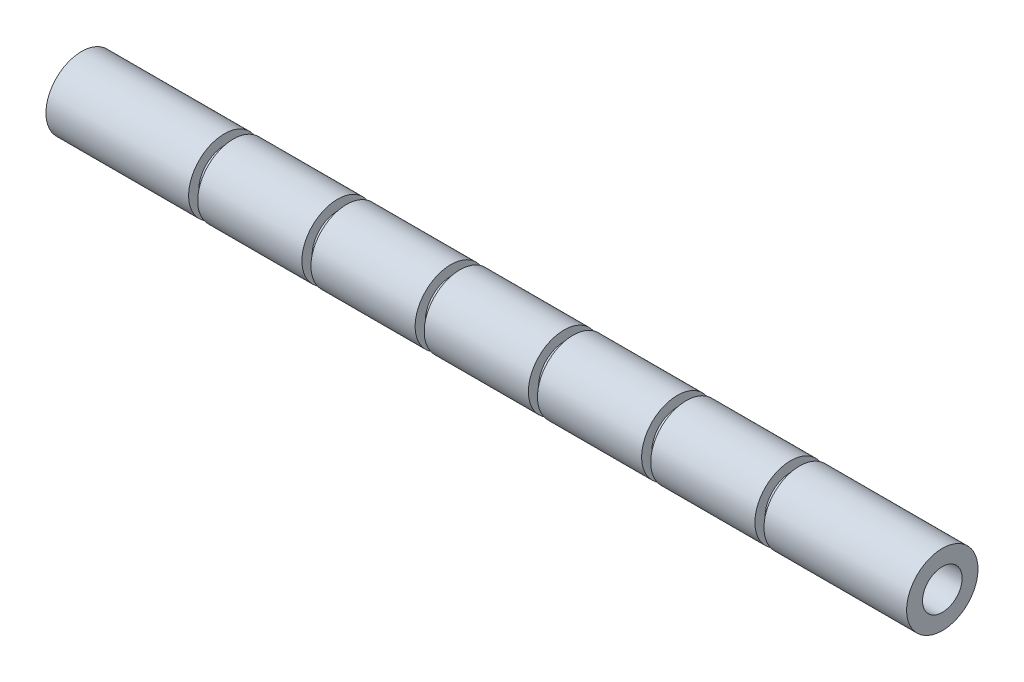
from build123d import *

# Parameters (mm, degrees)
ESQUISSE1_R                = 31.5
ESQUISSE1_R_2              = 17.5
EXTRUSION1_DEPTH           = 380
ESQUISSE2_W                = 8
ESQUISSE2_H                = 9
R_P_TITION_LIN_AIRE1_COUNT = 6
R_P_TITION_LIN_AIRE1_PITCH = 100


with BuildPart() as part:
    # Esquisse1 → Extrusion1 (new, symmetric)
    with BuildSketch(Plane(origin=(0, 0, 0), x_dir=(0, 0, -1), z_dir=(1, 0, 0))):
        Circle(ESQUISSE1_R)
        Circle(ESQUISSE1_R_2, mode=Mode.SUBTRACT)
    extrude(amount=EXTRUSION1_DEPTH, both=True)

    # Esquisse2 → Enl_vement de mati_re-R_volution1 (revolve, cut)
    with BuildSketch(Plane.XY, mode=Mode.PRIVATE) as enl_vement_de_mati_re_r_volution1_sk:
        with Locations((-250, 27)):
            Rectangle(ESQUISSE2_W, ESQUISSE2_H)
    enl_vement_de_mati_re_r_volution1 = revolve(enl_vement_de_mati_re_r_volution1_sk.sketch.rotate(Axis((0, 0, 0), (-1, 0, 0)), 90), axis=Axis((0, 0, 0), (-1, 0, 0)), mode=Mode.SUBTRACT)

    # R_p_tition lin_aire1: Enl_vement de mati_re-R_volution1 ×6
    with Locations(*[(i * R_P_TITION_LIN_AIRE1_PITCH, 0, 0) for i in range(1, R_P_TITION_LIN_AIRE1_COUNT)]):
        add(enl_vement_de_mati_re_r_volution1, mode=Mode.SUBTRACT)


solid = part.part
